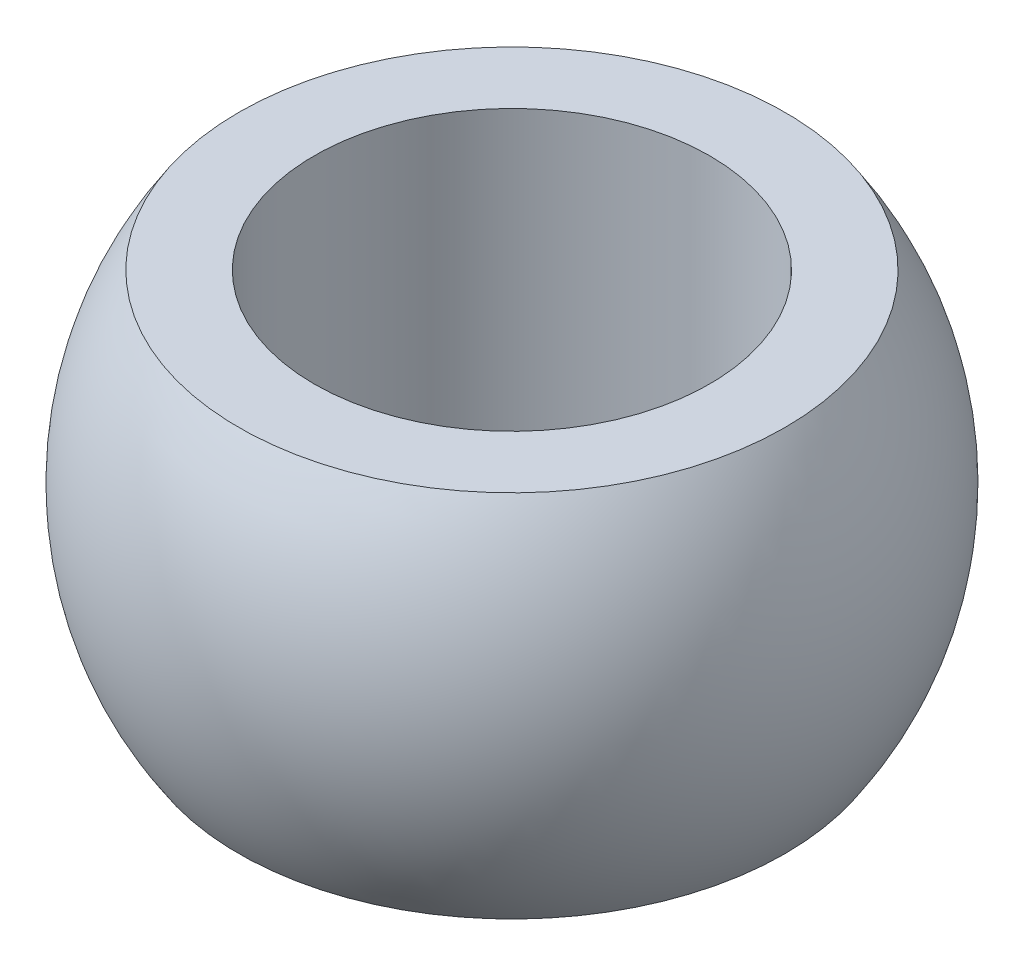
ISO-10303-21;
HEADER;
FILE_DESCRIPTION(('STEP AP214'),'2;1');
FILE_NAME('part.step','',(''),(''),'','','');
FILE_SCHEMA(('AUTOMOTIVE_DESIGN { 1 0 10303 214 1 1 1 1 }'));
ENDSEC;
DATA;
#1=APPLICATION_CONTEXT('core data for automotive mechanical design processes');
#2=APPLICATION_PROTOCOL_DEFINITION('international standard','automotive_design',2000,#1);
#3=PRODUCT_CONTEXT('',#1,'mechanical');
#4=PRODUCT('Part','Part','',(#3));
#5=PRODUCT_RELATED_PRODUCT_CATEGORY('part','',(#4));
#6=PRODUCT_DEFINITION_FORMATION('','',#4);
#7=PRODUCT_DEFINITION_CONTEXT('part definition',#1,'design');
#8=PRODUCT_DEFINITION('design','',#6,#7);
#9=PRODUCT_DEFINITION_SHAPE('','',#8);
#10=(LENGTH_UNIT() NAMED_UNIT(*) SI_UNIT(.MILLI.,.METRE.));
#11=(NAMED_UNIT(*) PLANE_ANGLE_UNIT() SI_UNIT($,.RADIAN.));
#12=(NAMED_UNIT(*) SI_UNIT($,.STERADIAN.) SOLID_ANGLE_UNIT());
#13=UNCERTAINTY_MEASURE_WITH_UNIT(LENGTH_MEASURE(1.E-05),#10,'distance_accuracy_value','');
#14=(GEOMETRIC_REPRESENTATION_CONTEXT(3) GLOBAL_UNCERTAINTY_ASSIGNED_CONTEXT((#13)) GLOBAL_UNIT_ASSIGNED_CONTEXT((#10,
#11,#12)) REPRESENTATION_CONTEXT('',''));
#15=CARTESIAN_POINT('',(0.,0.,0.));
#16=DIRECTION('',(0.,0.,1.));
#17=DIRECTION('',(1.,0.,0.));
#18=AXIS2_PLACEMENT_3D('',#15,#16,#17);
#19=CARTESIAN_POINT('',(0.,0.,0.));
#20=DIRECTION('',(0.,1.,0.));
#21=DIRECTION('',(1.,0.,0.));
#22=AXIS2_PLACEMENT_3D('',#19,#20,#21);
#23=SPHERICAL_SURFACE('',#22,12.5);
#24=CARTESIAN_POINT('',(0.,7.,0.));
#25=DIRECTION('',(0.,1.,0.));
#26=DIRECTION('',(0.,0.,1.));
#27=AXIS2_PLACEMENT_3D('',#24,#25,#26);
#28=CIRCLE('',#27,10.356157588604);
#29=CARTESIAN_POINT('',(10.356157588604,7.,0.));
#30=VERTEX_POINT('',#29);
#31=EDGE_CURVE('E42',#30,#30,#28,.T.);
#32=CARTESIAN_POINT('',(0.,-7.,0.));
#33=DIRECTION('',(0.,1.,0.));
#34=DIRECTION('',(0.,0.,1.));
#35=AXIS2_PLACEMENT_3D('',#32,#33,#34);
#36=CIRCLE('',#35,10.356157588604);
#37=CARTESIAN_POINT('',(10.356157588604,-7.,0.));
#38=VERTEX_POINT('',#37);
#39=EDGE_CURVE('E10',#38,#38,#36,.T.);
#40=CARTESIAN_POINT('',(10.356157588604,7.,0.));
#41=CARTESIAN_POINT('',(10.4428400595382,6.87176006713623,0.));
#42=CARTESIAN_POINT('',(10.5271381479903,6.7419085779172,0.));
#43=CARTESIAN_POINT('',(10.6908545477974,6.47916497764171,0.));
#44=CARTESIAN_POINT('',(10.7702728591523,6.34627286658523,0.));
#45=CARTESIAN_POINT('',(10.9241186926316,6.07763051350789,0.));
#46=CARTESIAN_POINT('',(10.998546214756,5.94188027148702,0.));
#47=CARTESIAN_POINT('',(11.1423081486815,5.66770921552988,0.));
#48=CARTESIAN_POINT('',(11.2116425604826,5.52928840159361,0.));
#49=CARTESIAN_POINT('',(11.3451224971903,5.24996714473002,0.));
#50=CARTESIAN_POINT('',(11.409268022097,5.10906670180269,0.));
#51=CARTESIAN_POINT('',(11.5322816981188,4.82498063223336,0.));
#52=CARTESIAN_POINT('',(11.5911498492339,4.68179500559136,0.));
#53=CARTESIAN_POINT('',(11.7035275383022,4.393336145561,0.));
#54=CARTESIAN_POINT('',(11.7570370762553,4.24806291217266,0.));
#55=CARTESIAN_POINT('',(11.8586237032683,3.95562930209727,0.));
#56=CARTESIAN_POINT('',(11.9067007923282,3.80846892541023,0.));
#57=CARTESIAN_POINT('',(11.9973561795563,3.51246409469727,0.));
#58=CARTESIAN_POINT('',(12.0399344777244,3.36361964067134,0.));
#59=CARTESIAN_POINT('',(12.1195335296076,3.06445204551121,0.));
#60=CARTESIAN_POINT('',(12.1565542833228,2.914128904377,0.));
#61=CARTESIAN_POINT('',(12.2249871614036,2.61221136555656,0.));
#62=CARTESIAN_POINT('',(12.2563992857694,2.46061696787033,0.));
#63=CARTESIAN_POINT('',(12.3135715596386,2.15636610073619,0.));
#64=CARTESIAN_POINT('',(12.3393317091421,2.00370963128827,0.));
#65=CARTESIAN_POINT('',(12.3851644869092,1.69754527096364,0.));
#66=CARTESIAN_POINT('',(12.4052371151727,1.54403738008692,0.));
#67=CARTESIAN_POINT('',(12.4396671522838,1.23638200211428,0.));
#68=CARTESIAN_POINT('',(12.4540245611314,1.08223451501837,0.));
#69=CARTESIAN_POINT('',(12.4770043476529,0.773512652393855,0.));
#70=CARTESIAN_POINT('',(12.4856267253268,0.61893827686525,0.));
#71=CARTESIAN_POINT('',(12.4971245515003,0.309575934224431,0.));
#72=CARTESIAN_POINT('',(12.5,0.154787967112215,0.));
#73=CARTESIAN_POINT('',(12.5,-0.154787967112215,0.));
#74=CARTESIAN_POINT('',(12.4971245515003,-0.309575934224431,0.));
#75=CARTESIAN_POINT('',(12.4856267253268,-0.61893827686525,0.));
#76=CARTESIAN_POINT('',(12.4770043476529,-0.773512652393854,0.));
#77=CARTESIAN_POINT('',(12.4540245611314,-1.08223451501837,0.));
#78=CARTESIAN_POINT('',(12.4396671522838,-1.23638200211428,0.));
#79=CARTESIAN_POINT('',(12.4052371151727,-1.54403738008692,0.));
#80=CARTESIAN_POINT('',(12.3851644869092,-1.69754527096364,0.));
#81=CARTESIAN_POINT('',(12.3393317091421,-2.00370963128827,0.));
#82=CARTESIAN_POINT('',(12.3135715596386,-2.15636610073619,0.));
#83=CARTESIAN_POINT('',(12.2563992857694,-2.46061696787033,0.));
#84=CARTESIAN_POINT('',(12.2249871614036,-2.61221136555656,0.));
#85=CARTESIAN_POINT('',(12.1565542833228,-2.914128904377,0.));
#86=CARTESIAN_POINT('',(12.1195335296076,-3.06445204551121,0.));
#87=CARTESIAN_POINT('',(12.0399344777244,-3.36361964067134,0.));
#88=CARTESIAN_POINT('',(11.9973561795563,-3.51246409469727,0.));
#89=CARTESIAN_POINT('',(11.9067007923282,-3.80846892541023,0.));
#90=CARTESIAN_POINT('',(11.8586237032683,-3.95562930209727,0.));
#91=CARTESIAN_POINT('',(11.7570370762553,-4.24806291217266,0.));
#92=CARTESIAN_POINT('',(11.7035275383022,-4.393336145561,0.));
#93=CARTESIAN_POINT('',(11.5911498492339,-4.68179500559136,0.));
#94=CARTESIAN_POINT('',(11.5322816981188,-4.82498063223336,0.));
#95=CARTESIAN_POINT('',(11.409268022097,-5.10906670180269,0.));
#96=CARTESIAN_POINT('',(11.3451224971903,-5.24996714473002,0.));
#97=CARTESIAN_POINT('',(11.2116425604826,-5.52928840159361,0.));
#98=CARTESIAN_POINT('',(11.1423081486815,-5.66770921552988,0.));
#99=CARTESIAN_POINT('',(10.998546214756,-5.94188027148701,0.));
#100=CARTESIAN_POINT('',(10.9241186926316,-6.07763051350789,0.));
#101=CARTESIAN_POINT('',(10.7702728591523,-6.34627286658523,0.));
#102=CARTESIAN_POINT('',(10.6908545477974,-6.47916497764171,0.));
#103=CARTESIAN_POINT('',(10.5271381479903,-6.7419085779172,0.));
#104=CARTESIAN_POINT('',(10.4428400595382,-6.87176006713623,0.));
#105=CARTESIAN_POINT('',(10.356157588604,-7.,0.));
#106=B_SPLINE_CURVE_WITH_KNOTS('',3,(#40,#41,#42,#43,#44,#45,#46,#47,#48,#49,#50,#51,#52,#53,
#54,#55,#56,#57,#58,#59,#60,#61,#62,#63,#64,#65,#66,#67,#68,#69,#70,#71,#72,#73,#74,#75,#76,#77,
#78,#79,#80,#81,#82,#83,#84,#85,#86,#87,#88,#89,#90,#91,#92,#93,#94,#95,#96,#97,#98,#99,#100,
#101,#102,#103,#104,#105),.UNSPECIFIED.,.F.,.F.,(4,2,2,2,2,2,2,2,2,2,2,2,2,2,2,2,2,2,2,2,2,2,2,
2,2,2,2,2,2,2,2,2,4),(0.,0.464337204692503,0.928674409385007,1.39301161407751,1.85734881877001,
2.32168602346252,2.78602322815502,3.25036043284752,3.71469763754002,4.17903484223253,
4.64337204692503,5.10770925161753,5.57204645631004,6.03638366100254,6.50072086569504,
6.96505807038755,7.42939527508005,7.89373247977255,8.35806968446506,8.82240688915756,
9.28674409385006,9.75108129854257,10.2154185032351,10.6797557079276,11.1440929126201,
11.6084301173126,12.0727673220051,12.5371045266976,13.0014417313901,13.4657789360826,
13.9301161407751,14.3944533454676,14.8587905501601),.UNSPECIFIED.);
#107=EDGE_CURVE('BSEAM28',#30,#38,#106,.T.);
#108=ORIENTED_EDGE('',*,*,#31,.F.);
#109=ORIENTED_EDGE('',*,*,#39,.T.);
#110=ORIENTED_EDGE('',*,*,#107,.T.);
#111=ORIENTED_EDGE('',*,*,#107,.F.);
#112=EDGE_LOOP('',(#108,#110,#109,#111));
#113=FACE_BOUND('',#112,.T.);
#114=ADVANCED_FACE('F28',(#113),#23,.T.);
#115=CARTESIAN_POINT('',(7.5,-7.,0.));
#116=DIRECTION('',(0.,1.,0.));
#117=DIRECTION('',(0.,0.,1.));
#118=AXIS2_PLACEMENT_3D('',#115,#116,#117);
#119=PLANE('',#118);
#120=ORIENTED_EDGE('',*,*,#39,.F.);
#121=EDGE_LOOP('',(#120));
#122=FACE_BOUND('',#121,.T.);
#123=CARTESIAN_POINT('',(0.,-7.,0.));
#124=DIRECTION('',(0.,1.,0.));
#125=DIRECTION('',(0.,0.,1.));
#126=AXIS2_PLACEMENT_3D('',#123,#124,#125);
#127=CIRCLE('',#126,7.5);
#128=CARTESIAN_POINT('',(0.,-7.,7.5));
#129=VERTEX_POINT('',#128);
#130=EDGE_CURVE('E34',#129,#129,#127,.T.);
#131=ORIENTED_EDGE('',*,*,#130,.T.);
#132=EDGE_LOOP('',(#131));
#133=FACE_BOUND('',#132,.T.);
#134=ADVANCED_FACE('F51',(#122,#133),#119,.F.);
#135=CARTESIAN_POINT('',(0.,10.3802565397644,0.));
#136=DIRECTION('',(0.,1.,0.));
#137=DIRECTION('',(0.,0.,1.));
#138=AXIS2_PLACEMENT_3D('',#135,#136,#137);
#139=CYLINDRICAL_SURFACE('',#138,7.5);
#140=ORIENTED_EDGE('',*,*,#130,.F.);
#141=EDGE_LOOP('',(#140));
#142=FACE_BOUND('',#141,.T.);
#143=CARTESIAN_POINT('',(0.,7.,0.));
#144=DIRECTION('',(0.,1.,0.));
#145=DIRECTION('',(0.,0.,1.));
#146=AXIS2_PLACEMENT_3D('',#143,#144,#145);
#147=CIRCLE('',#146,7.5);
#148=CARTESIAN_POINT('',(0.,7.,7.5));
#149=VERTEX_POINT('',#148);
#150=EDGE_CURVE('E38',#149,#149,#147,.T.);
#151=ORIENTED_EDGE('',*,*,#150,.T.);
#152=EDGE_LOOP('',(#151));
#153=FACE_BOUND('',#152,.T.);
#154=ADVANCED_FACE('F55',(#142,#153),#139,.F.);
#155=CARTESIAN_POINT('',(10.356157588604,7.,0.));
#156=DIRECTION('',(0.,-1.,0.));
#157=DIRECTION('',(0.,0.,-1.));
#158=AXIS2_PLACEMENT_3D('',#155,#156,#157);
#159=PLANE('',#158);
#160=ORIENTED_EDGE('',*,*,#150,.F.);
#161=EDGE_LOOP('',(#160));
#162=FACE_BOUND('',#161,.T.);
#163=ORIENTED_EDGE('',*,*,#31,.T.);
#164=EDGE_LOOP('',(#163));
#165=FACE_BOUND('',#164,.T.);
#166=ADVANCED_FACE('F48',(#162,#165),#159,.F.);
#167=CLOSED_SHELL('',(#114,#134,#154,#166));
#168=MANIFOLD_SOLID_BREP('B2',#167);
#169=ADVANCED_BREP_SHAPE_REPRESENTATION('',(#18,#168),#14);
#170=SHAPE_DEFINITION_REPRESENTATION(#9,#169);
ENDSEC;
END-ISO-10303-21;
